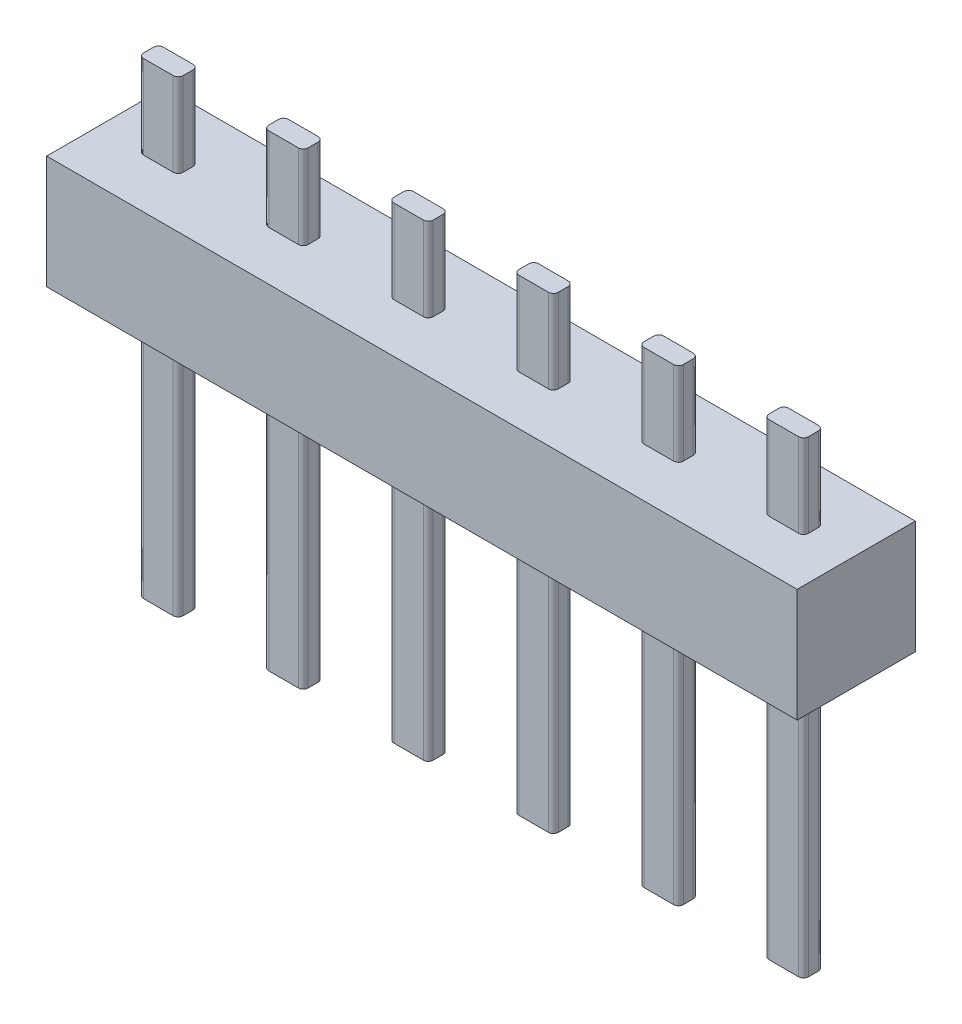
from build123d import *

# Parameters (mm, degrees)
ESQUISSE1_W           = 2.4
ESQUISSE1_H           = 2.3
EXTRUSION1_DEPTH      = 15.24
EXTRUSION2_DEPTH      = 5.5
EXTRUSION2_DEPTH_BACK = 4


with BuildPart() as part:
    # Esquisse1 → Extrusion1 (new body)
    with BuildSketch(Plane(origin=(0, 0, 0), x_dir=(0, 0, -1), z_dir=(1, 0, 0))):
        with Locations((1.2, 1.15)):
            Rectangle(ESQUISSE1_W, ESQUISSE1_H)
    extrude(amount=EXTRUSION1_DEPTH)

    # Esquisse3 → Extrusion2 (add, two sides: drawn at the far end of the back side and taken through both)
    with BuildSketch(Plane.XZ.offset(-EXTRUSION2_DEPTH_BACK)):
        with BuildLine():
            Line((14.27, -1), (13.67, -1))
            ThreePointArc((13.67, -1), (13.599289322, -1.029289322), (13.57, -1.1))
            Line((13.57, -1.1), (13.57, -1.3))
            ThreePointArc((13.57, -1.3), (13.599289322, -1.370710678), (13.67, -1.4))
            Line((13.67, -1.4), (14.27, -1.4))
            ThreePointArc((14.27, -1.4), (14.340710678, -1.370710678), (14.37, -1.3))
            Line((14.37, -1.3), (14.37, -1.1))
            ThreePointArc((14.37, -1.1), (14.340710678, -1.029289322), (14.27, -1))
        make_face()
        with BuildLine():
            Line((11.73, -1), (11.13, -1))
            ThreePointArc((11.13, -1), (11.059289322, -1.029289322), (11.03, -1.1))
            Line((11.03, -1.1), (11.03, -1.3))
            ThreePointArc((11.03, -1.3), (11.059289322, -1.370710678), (11.13, -1.4))
            Line((11.13, -1.4), (11.73, -1.4))
            ThreePointArc((11.73, -1.4), (11.800710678, -1.370710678), (11.83, -1.3))
            Line((11.83, -1.3), (11.83, -1.1))
            ThreePointArc((11.83, -1.1), (11.800710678, -1.029289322), (11.73, -1))
        make_face()
        with BuildLine():
            Line((9.19, -1), (8.59, -1))
            ThreePointArc((8.59, -1), (8.519289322, -1.029289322), (8.49, -1.1))
            Line((8.49, -1.1), (8.49, -1.3))
            ThreePointArc((8.49, -1.3), (8.519289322, -1.370710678), (8.59, -1.4))
            Line((8.59, -1.4), (9.19, -1.4))
            ThreePointArc((9.19, -1.4), (9.260710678, -1.370710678), (9.29, -1.3))
            Line((9.29, -1.3), (9.29, -1.1))
            ThreePointArc((9.29, -1.1), (9.260710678, -1.029289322), (9.19, -1))
        make_face()
        with BuildLine():
            Line((6.65, -1), (6.05, -1))
            ThreePointArc((6.05, -1), (5.979289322, -1.029289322), (5.95, -1.1))
            Line((5.95, -1.1), (5.95, -1.3))
            ThreePointArc((5.95, -1.3), (5.979289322, -1.370710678), (6.05, -1.4))
            Line((6.05, -1.4), (6.65, -1.4))
            ThreePointArc((6.65, -1.4), (6.720710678, -1.370710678), (6.75, -1.3))
            Line((6.75, -1.3), (6.75, -1.1))
            ThreePointArc((6.75, -1.1), (6.720710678, -1.029289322), (6.65, -1))
        make_face()
        with BuildLine():
            Line((4.11, -1), (3.51, -1))
            ThreePointArc((3.51, -1), (3.439289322, -1.029289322), (3.41, -1.1))
            Line((3.41, -1.1), (3.41, -1.3))
            ThreePointArc((3.41, -1.3), (3.439289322, -1.370710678), (3.51, -1.4))
            Line((3.51, -1.4), (4.11, -1.4))
            ThreePointArc((4.11, -1.4), (4.180710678, -1.370710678), (4.21, -1.3))
            Line((4.21, -1.3), (4.21, -1.1))
            ThreePointArc((4.21, -1.1), (4.180710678, -1.029289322), (4.11, -1))
        make_face()
        with BuildLine():
            Line((1.57, -1), (0.97, -1))
            ThreePointArc((0.97, -1), (0.899289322, -1.029289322), (0.87, -1.1))
            Line((0.87, -1.1), (0.87, -1.3))
            ThreePointArc((0.87, -1.3), (0.899289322, -1.370710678), (0.97, -1.4))
            Line((0.97, -1.4), (1.57, -1.4))
            ThreePointArc((1.57, -1.4), (1.640710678, -1.370710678), (1.67, -1.3))
            Line((1.67, -1.3), (1.67, -1.1))
            ThreePointArc((1.67, -1.1), (1.640710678, -1.029289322), (1.57, -1))
        make_face()
    extrude(amount=EXTRUSION2_DEPTH + EXTRUSION2_DEPTH_BACK)


solid = part.part
